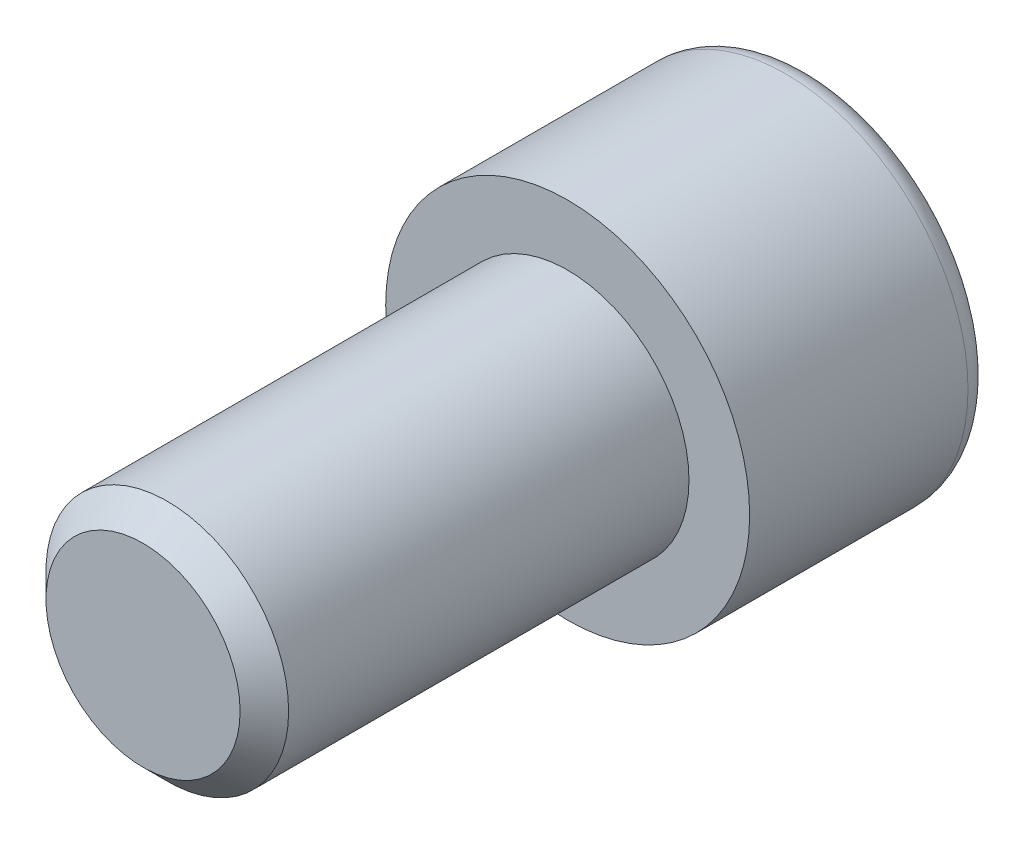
ISO-10303-21;
HEADER;
FILE_DESCRIPTION(('STEP AP214'),'2;1');
FILE_NAME('part.step','',(''),(''),'','','');
FILE_SCHEMA(('AUTOMOTIVE_DESIGN { 1 0 10303 214 1 1 1 1 }'));
ENDSEC;
DATA;
#1=APPLICATION_CONTEXT('core data for automotive mechanical design processes');
#2=APPLICATION_PROTOCOL_DEFINITION('international standard','automotive_design',2000,#1);
#3=PRODUCT_CONTEXT('',#1,'mechanical');
#4=PRODUCT('Part','Part','',(#3));
#5=PRODUCT_RELATED_PRODUCT_CATEGORY('part','',(#4));
#6=PRODUCT_DEFINITION_FORMATION('','',#4);
#7=PRODUCT_DEFINITION_CONTEXT('part definition',#1,'design');
#8=PRODUCT_DEFINITION('design','',#6,#7);
#9=PRODUCT_DEFINITION_SHAPE('','',#8);
#10=(LENGTH_UNIT() NAMED_UNIT(*) SI_UNIT(.MILLI.,.METRE.));
#11=(NAMED_UNIT(*) PLANE_ANGLE_UNIT() SI_UNIT($,.RADIAN.));
#12=(NAMED_UNIT(*) SI_UNIT($,.STERADIAN.) SOLID_ANGLE_UNIT());
#13=UNCERTAINTY_MEASURE_WITH_UNIT(LENGTH_MEASURE(1.E-05),#10,'distance_accuracy_value','');
#14=(GEOMETRIC_REPRESENTATION_CONTEXT(3) GLOBAL_UNCERTAINTY_ASSIGNED_CONTEXT((#13)) GLOBAL_UNIT_ASSIGNED_CONTEXT((#10,
#11,#12)) REPRESENTATION_CONTEXT('',''));
#15=CARTESIAN_POINT('',(0.,0.,0.));
#16=DIRECTION('',(0.,0.,1.));
#17=DIRECTION('',(1.,0.,0.));
#18=AXIS2_PLACEMENT_3D('',#15,#16,#17);
#19=CARTESIAN_POINT('',(0.,0.,-16.));
#20=DIRECTION('',(0.,0.,1.));
#21=DIRECTION('',(1.,0.,0.));
#22=AXIS2_PLACEMENT_3D('',#19,#20,#21);
#23=PLANE('',#22);
#24=CARTESIAN_POINT('',(0.,0.,-16.));
#25=DIRECTION('',(0.,0.,-1.));
#26=DIRECTION('',(-1.,0.,0.));
#27=AXIS2_PLACEMENT_3D('',#24,#25,#26);
#28=CIRCLE('',#27,10.4);
#29=CARTESIAN_POINT('',(-10.4,0.,-16.));
#30=VERTEX_POINT('',#29);
#31=EDGE_CURVE('E150',#30,#30,#28,.T.);
#32=ORIENTED_EDGE('',*,*,#31,.T.);
#33=EDGE_LOOP('',(#32));
#34=FACE_BOUND('',#33,.T.);
#35=DIRECTION('',(-0.86602540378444,0.499999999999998,0.));
#36=VECTOR('',#35,1.);
#37=CARTESIAN_POINT('',(0.,8.08290376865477,-16.));
#38=LINE('',#37,#36);
#39=CARTESIAN_POINT('',(7.,4.0414518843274,-16.));
#40=VERTEX_POINT('',#39);
#41=CARTESIAN_POINT('',(0.,8.08290376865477,-16.));
#42=VERTEX_POINT('',#41);
#43=EDGE_CURVE('E54',#40,#42,#38,.T.);
#44=ORIENTED_EDGE('',*,*,#43,.T.);
#45=DIRECTION('',(-0.866025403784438,-0.500000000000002,0.));
#46=VECTOR('',#45,1.);
#47=CARTESIAN_POINT('',(0.,8.08290376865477,-16.));
#48=LINE('',#47,#46);
#49=CARTESIAN_POINT('',(-7.,4.0414518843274,-16.));
#50=VERTEX_POINT('',#49);
#51=EDGE_CURVE('E94',#42,#50,#48,.T.);
#52=ORIENTED_EDGE('',*,*,#51,.T.);
#53=DIRECTION('',(0.,-1.,0.));
#54=VECTOR('',#53,1.);
#55=CARTESIAN_POINT('',(-7.,-4.0414518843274,-16.));
#56=LINE('',#55,#54);
#57=CARTESIAN_POINT('',(-7.,-4.0414518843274,-16.));
#58=VERTEX_POINT('',#57);
#59=EDGE_CURVE('E102',#50,#58,#56,.T.);
#60=ORIENTED_EDGE('',*,*,#59,.T.);
#61=DIRECTION('',(0.866025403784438,-0.500000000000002,0.));
#62=VECTOR('',#61,1.);
#63=CARTESIAN_POINT('',(0.,-8.08290376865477,-16.));
#64=LINE('',#63,#62);
#65=CARTESIAN_POINT('',(0.,-8.08290376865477,-16.));
#66=VERTEX_POINT('',#65);
#67=EDGE_CURVE('E120',#58,#66,#64,.T.);
#68=ORIENTED_EDGE('',*,*,#67,.T.);
#69=DIRECTION('',(0.86602540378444,0.499999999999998,0.));
#70=VECTOR('',#69,1.);
#71=CARTESIAN_POINT('',(0.,-8.08290376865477,-16.));
#72=LINE('',#71,#70);
#73=CARTESIAN_POINT('',(7.,-4.0414518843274,-16.));
#74=VERTEX_POINT('',#73);
#75=EDGE_CURVE('E123',#66,#74,#72,.T.);
#76=ORIENTED_EDGE('',*,*,#75,.T.);
#77=DIRECTION('',(0.,1.,0.));
#78=VECTOR('',#77,1.);
#79=CARTESIAN_POINT('',(7.,-4.0414518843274,-16.));
#80=LINE('',#79,#78);
#81=EDGE_CURVE('E113',#74,#40,#80,.T.);
#82=ORIENTED_EDGE('',*,*,#81,.T.);
#83=EDGE_LOOP('',(#44,#52,#60,#68,#76,#82));
#84=FACE_BOUND('',#83,.T.);
#85=ADVANCED_FACE('F39',(#34,#84),#23,.F.);
#86=CARTESIAN_POINT('',(0.,0.,-14.4));
#87=DIRECTION('',(0.,0.,-1.));
#88=DIRECTION('',(-1.,0.,0.));
#89=AXIS2_PLACEMENT_3D('',#86,#87,#88);
#90=TOROIDAL_SURFACE('',#89,10.4,1.6);
#91=ORIENTED_EDGE('',*,*,#31,.F.);
#92=EDGE_LOOP('',(#91));
#93=FACE_BOUND('',#92,.T.);
#94=CARTESIAN_POINT('',(0.,0.,-14.4));
#95=DIRECTION('',(0.,0.,-1.));
#96=DIRECTION('',(-1.,0.,0.));
#97=AXIS2_PLACEMENT_3D('',#94,#95,#96);
#98=CIRCLE('',#97,12.);
#99=CARTESIAN_POINT('',(-12.,0.,-14.4));
#100=VERTEX_POINT('',#99);
#101=EDGE_CURVE('E147',#100,#100,#98,.T.);
#102=ORIENTED_EDGE('',*,*,#101,.T.);
#103=EDGE_LOOP('',(#102));
#104=FACE_BOUND('',#103,.T.);
#105=ADVANCED_FACE('F169',(#93,#104),#90,.T.);
#106=CARTESIAN_POINT('',(0.,0.,0.));
#107=DIRECTION('',(0.,0.,-1.));
#108=DIRECTION('',(-1.,0.,0.));
#109=AXIS2_PLACEMENT_3D('',#106,#107,#108);
#110=CYLINDRICAL_SURFACE('',#109,12.);
#111=ORIENTED_EDGE('',*,*,#101,.F.);
#112=EDGE_LOOP('',(#111));
#113=FACE_BOUND('',#112,.T.);
#114=CARTESIAN_POINT('',(0.,0.,0.));
#115=DIRECTION('',(0.,0.,-1.));
#116=DIRECTION('',(-1.,0.,0.));
#117=AXIS2_PLACEMENT_3D('',#114,#115,#116);
#118=CIRCLE('',#117,12.);
#119=CARTESIAN_POINT('',(-12.,0.,0.));
#120=VERTEX_POINT('',#119);
#121=EDGE_CURVE('E108',#120,#120,#118,.T.);
#122=ORIENTED_EDGE('',*,*,#121,.T.);
#123=EDGE_LOOP('',(#122));
#124=FACE_BOUND('',#123,.T.);
#125=ADVANCED_FACE('F174',(#113,#124),#110,.T.);
#126=CARTESIAN_POINT('',(0.,0.,0.));
#127=DIRECTION('',(0.,0.,-1.));
#128=DIRECTION('',(-1.,0.,0.));
#129=AXIS2_PLACEMENT_3D('',#126,#127,#128);
#130=PLANE('',#129);
#131=CARTESIAN_POINT('',(0.,0.,0.));
#132=DIRECTION('',(0.,0.,1.));
#133=DIRECTION('',(1.,0.,0.));
#134=AXIS2_PLACEMENT_3D('',#131,#132,#133);
#135=CIRCLE('',#134,8.);
#136=CARTESIAN_POINT('',(8.,0.,0.));
#137=VERTEX_POINT('',#136);
#138=EDGE_CURVE('E114',#137,#137,#135,.T.);
#139=ORIENTED_EDGE('',*,*,#138,.F.);
#140=EDGE_LOOP('',(#139));
#141=FACE_BOUND('',#140,.T.);
#142=ORIENTED_EDGE('',*,*,#121,.F.);
#143=EDGE_LOOP('',(#142));
#144=FACE_BOUND('',#143,.T.);
#145=ADVANCED_FACE('F182',(#141,#144),#130,.F.);
#146=CARTESIAN_POINT('',(0.,8.08290376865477,-8.));
#147=DIRECTION('',(-0.499999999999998,-0.86602540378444,0.));
#148=DIRECTION('',(0.86602540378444,-0.499999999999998,0.));
#149=AXIS2_PLACEMENT_3D('',#146,#147,#148);
#150=PLANE('',#149);
#151=ORIENTED_EDGE('',*,*,#43,.F.);
#152=DIRECTION('',(0.,0.,-1.));
#153=VECTOR('',#152,1.);
#154=CARTESIAN_POINT('',(7.,4.0414518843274,-8.));
#155=LINE('',#154,#153);
#156=CARTESIAN_POINT('',(7.,4.0414518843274,-8.));
#157=VERTEX_POINT('',#156);
#158=EDGE_CURVE('E136',#157,#40,#155,.T.);
#159=ORIENTED_EDGE('',*,*,#158,.F.);
#160=DIRECTION('',(-0.86602540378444,0.499999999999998,0.));
#161=VECTOR('',#160,1.);
#162=CARTESIAN_POINT('',(0.,8.08290376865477,-8.));
#163=LINE('',#162,#161);
#164=CARTESIAN_POINT('',(0.,8.08290376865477,-8.));
#165=VERTEX_POINT('',#164);
#166=EDGE_CURVE('E107',#157,#165,#163,.T.);
#167=ORIENTED_EDGE('',*,*,#166,.T.);
#168=DIRECTION('',(0.,0.,-1.));
#169=VECTOR('',#168,1.);
#170=CARTESIAN_POINT('',(0.,8.08290376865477,-8.));
#171=LINE('',#170,#169);
#172=EDGE_CURVE('E96',#165,#42,#171,.T.);
#173=ORIENTED_EDGE('',*,*,#172,.T.);
#174=EDGE_LOOP('',(#151,#159,#167,#173));
#175=FACE_BOUND('',#174,.T.);
#176=ADVANCED_FACE('F105',(#175),#150,.T.);
#177=CARTESIAN_POINT('',(0.,8.08290376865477,-8.));
#178=DIRECTION('',(0.500000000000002,-0.866025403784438,0.));
#179=DIRECTION('',(0.866025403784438,0.500000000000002,0.));
#180=AXIS2_PLACEMENT_3D('',#177,#178,#179);
#181=PLANE('',#180);
#182=ORIENTED_EDGE('',*,*,#51,.F.);
#183=ORIENTED_EDGE('',*,*,#172,.F.);
#184=DIRECTION('',(-0.866025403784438,-0.500000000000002,0.));
#185=VECTOR('',#184,1.);
#186=CARTESIAN_POINT('',(0.,8.08290376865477,-8.));
#187=LINE('',#186,#185);
#188=CARTESIAN_POINT('',(-7.,4.0414518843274,-8.));
#189=VERTEX_POINT('',#188);
#190=EDGE_CURVE('E127',#165,#189,#187,.T.);
#191=ORIENTED_EDGE('',*,*,#190,.T.);
#192=DIRECTION('',(0.,0.,-1.));
#193=VECTOR('',#192,1.);
#194=CARTESIAN_POINT('',(-7.,4.0414518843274,-8.));
#195=LINE('',#194,#193);
#196=EDGE_CURVE('E98',#189,#50,#195,.T.);
#197=ORIENTED_EDGE('',*,*,#196,.T.);
#198=EDGE_LOOP('',(#182,#183,#191,#197));
#199=FACE_BOUND('',#198,.T.);
#200=ADVANCED_FACE('F95',(#199),#181,.T.);
#201=CARTESIAN_POINT('',(-7.,-4.0414518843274,-8.));
#202=DIRECTION('',(1.,0.,0.));
#203=DIRECTION('',(0.,0.,-1.));
#204=AXIS2_PLACEMENT_3D('',#201,#202,#203);
#205=PLANE('',#204);
#206=ORIENTED_EDGE('',*,*,#59,.F.);
#207=ORIENTED_EDGE('',*,*,#196,.F.);
#208=DIRECTION('',(0.,-1.,0.));
#209=VECTOR('',#208,1.);
#210=CARTESIAN_POINT('',(-7.,-4.0414518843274,-8.));
#211=LINE('',#210,#209);
#212=CARTESIAN_POINT('',(-7.,-4.0414518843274,-8.));
#213=VERTEX_POINT('',#212);
#214=EDGE_CURVE('E129',#189,#213,#211,.T.);
#215=ORIENTED_EDGE('',*,*,#214,.T.);
#216=DIRECTION('',(0.,0.,-1.));
#217=VECTOR('',#216,1.);
#218=CARTESIAN_POINT('',(-7.,-4.0414518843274,-8.));
#219=LINE('',#218,#217);
#220=EDGE_CURVE('E142',#213,#58,#219,.T.);
#221=ORIENTED_EDGE('',*,*,#220,.T.);
#222=EDGE_LOOP('',(#206,#207,#215,#221));
#223=FACE_BOUND('',#222,.T.);
#224=ADVANCED_FACE('F197',(#223),#205,.T.);
#225=CARTESIAN_POINT('',(0.,-8.08290376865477,-8.));
#226=DIRECTION('',(0.500000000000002,0.866025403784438,0.));
#227=DIRECTION('',(-0.866025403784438,0.500000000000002,0.));
#228=AXIS2_PLACEMENT_3D('',#225,#226,#227);
#229=PLANE('',#228);
#230=ORIENTED_EDGE('',*,*,#67,.F.);
#231=ORIENTED_EDGE('',*,*,#220,.F.);
#232=DIRECTION('',(0.866025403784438,-0.500000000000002,0.));
#233=VECTOR('',#232,1.);
#234=CARTESIAN_POINT('',(0.,-8.08290376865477,-8.));
#235=LINE('',#234,#233);
#236=CARTESIAN_POINT('',(0.,-8.08290376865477,-8.));
#237=VERTEX_POINT('',#236);
#238=EDGE_CURVE('E131',#213,#237,#235,.T.);
#239=ORIENTED_EDGE('',*,*,#238,.T.);
#240=DIRECTION('',(0.,0.,-1.));
#241=VECTOR('',#240,1.);
#242=CARTESIAN_POINT('',(0.,-8.08290376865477,-8.));
#243=LINE('',#242,#241);
#244=EDGE_CURVE('E140',#237,#66,#243,.T.);
#245=ORIENTED_EDGE('',*,*,#244,.T.);
#246=EDGE_LOOP('',(#230,#231,#239,#245));
#247=FACE_BOUND('',#246,.T.);
#248=ADVANCED_FACE('F200',(#247),#229,.T.);
#249=CARTESIAN_POINT('',(0.,-8.08290376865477,-8.));
#250=DIRECTION('',(-0.499999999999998,0.86602540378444,0.));
#251=DIRECTION('',(-0.86602540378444,-0.499999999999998,0.));
#252=AXIS2_PLACEMENT_3D('',#249,#250,#251);
#253=PLANE('',#252);
#254=ORIENTED_EDGE('',*,*,#75,.F.);
#255=ORIENTED_EDGE('',*,*,#244,.F.);
#256=DIRECTION('',(0.86602540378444,0.499999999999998,0.));
#257=VECTOR('',#256,1.);
#258=CARTESIAN_POINT('',(0.,-8.08290376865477,-8.));
#259=LINE('',#258,#257);
#260=CARTESIAN_POINT('',(7.,-4.0414518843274,-8.));
#261=VERTEX_POINT('',#260);
#262=EDGE_CURVE('E133',#237,#261,#259,.T.);
#263=ORIENTED_EDGE('',*,*,#262,.T.);
#264=DIRECTION('',(0.,0.,-1.));
#265=VECTOR('',#264,1.);
#266=CARTESIAN_POINT('',(7.,-4.0414518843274,-8.));
#267=LINE('',#266,#265);
#268=EDGE_CURVE('E138',#261,#74,#267,.T.);
#269=ORIENTED_EDGE('',*,*,#268,.T.);
#270=EDGE_LOOP('',(#254,#255,#263,#269));
#271=FACE_BOUND('',#270,.T.);
#272=ADVANCED_FACE('F204',(#271),#253,.T.);
#273=CARTESIAN_POINT('',(7.,-4.0414518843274,-8.));
#274=DIRECTION('',(-1.,0.,0.));
#275=DIRECTION('',(0.,0.,1.));
#276=AXIS2_PLACEMENT_3D('',#273,#274,#275);
#277=PLANE('',#276);
#278=ORIENTED_EDGE('',*,*,#81,.F.);
#279=ORIENTED_EDGE('',*,*,#268,.F.);
#280=DIRECTION('',(0.,1.,0.));
#281=VECTOR('',#280,1.);
#282=CARTESIAN_POINT('',(7.,-4.0414518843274,-8.));
#283=LINE('',#282,#281);
#284=EDGE_CURVE('E61',#261,#157,#283,.T.);
#285=ORIENTED_EDGE('',*,*,#284,.T.);
#286=ORIENTED_EDGE('',*,*,#158,.T.);
#287=EDGE_LOOP('',(#278,#279,#285,#286));
#288=FACE_BOUND('',#287,.T.);
#289=ADVANCED_FACE('F208',(#288),#277,.T.);
#290=CARTESIAN_POINT('',(7.,4.0414518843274,-8.));
#291=DIRECTION('',(0.,0.,1.));
#292=DIRECTION('',(1.,0.,0.));
#293=AXIS2_PLACEMENT_3D('',#290,#291,#292);
#294=PLANE('',#293);
#295=ORIENTED_EDGE('',*,*,#166,.F.);
#296=ORIENTED_EDGE('',*,*,#284,.F.);
#297=ORIENTED_EDGE('',*,*,#262,.F.);
#298=ORIENTED_EDGE('',*,*,#238,.F.);
#299=ORIENTED_EDGE('',*,*,#214,.F.);
#300=ORIENTED_EDGE('',*,*,#190,.F.);
#301=EDGE_LOOP('',(#295,#296,#297,#298,#299,#300));
#302=FACE_BOUND('',#301,.T.);
#303=ADVANCED_FACE('F212',(#302),#294,.F.);
#304=CARTESIAN_POINT('',(0.,0.,28.));
#305=DIRECTION('',(0.,0.,1.));
#306=DIRECTION('',(1.,0.,0.));
#307=AXIS2_PLACEMENT_3D('',#304,#305,#306);
#308=PLANE('',#307);
#309=CARTESIAN_POINT('',(0.,0.,28.));
#310=DIRECTION('',(0.,0.,1.));
#311=DIRECTION('',(1.,0.,0.));
#312=AXIS2_PLACEMENT_3D('',#309,#310,#311);
#313=CIRCLE('',#312,6.4);
#314=CARTESIAN_POINT('',(6.4,0.,28.));
#315=VERTEX_POINT('',#314);
#316=EDGE_CURVE('E46',#315,#315,#313,.T.);
#317=ORIENTED_EDGE('',*,*,#316,.T.);
#318=EDGE_LOOP('',(#317));
#319=FACE_BOUND('',#318,.T.);
#320=ADVANCED_FACE('F155',(#319),#308,.T.);
#321=CARTESIAN_POINT('',(0.,0.,0.));
#322=DIRECTION('',(0.,0.,1.));
#323=DIRECTION('',(1.,0.,0.));
#324=AXIS2_PLACEMENT_3D('',#321,#322,#323);
#325=CYLINDRICAL_SURFACE('',#324,8.);
#326=CARTESIAN_POINT('',(0.,0.,26.4));
#327=DIRECTION('',(0.,0.,1.));
#328=DIRECTION('',(1.,0.,0.));
#329=AXIS2_PLACEMENT_3D('',#326,#327,#328);
#330=CIRCLE('',#329,8.);
#331=CARTESIAN_POINT('',(8.,0.,26.4));
#332=VERTEX_POINT('',#331);
#333=EDGE_CURVE('E11',#332,#332,#330,.F.);
#334=ORIENTED_EDGE('',*,*,#333,.T.);
#335=EDGE_LOOP('',(#334));
#336=FACE_BOUND('',#335,.T.);
#337=ORIENTED_EDGE('',*,*,#138,.T.);
#338=EDGE_LOOP('',(#337));
#339=FACE_BOUND('',#338,.T.);
#340=ADVANCED_FACE('F159',(#336,#339),#325,.T.);
#341=CARTESIAN_POINT('',(0.,0.,28.));
#342=DIRECTION('',(0.,0.,-1.));
#343=DIRECTION('',(-1.,0.,0.));
#344=AXIS2_PLACEMENT_3D('',#341,#342,#343);
#345=CONICAL_SURFACE('',#344,6.4,0.785398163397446);
#346=ORIENTED_EDGE('',*,*,#333,.F.);
#347=EDGE_LOOP('',(#346));
#348=FACE_BOUND('',#347,.T.);
#349=ORIENTED_EDGE('',*,*,#316,.F.);
#350=EDGE_LOOP('',(#349));
#351=FACE_BOUND('',#350,.T.);
#352=ADVANCED_FACE('F157',(#348,#351),#345,.T.);
#353=CLOSED_SHELL('',(#85,#105,#125,#145,#176,#200,#224,#248,#272,#289,#303,#320,#340,#352));
#354=MANIFOLD_SOLID_BREP('B2',#353);
#355=ADVANCED_BREP_SHAPE_REPRESENTATION('',(#18,#354),#14);
#356=SHAPE_DEFINITION_REPRESENTATION(#9,#355);
ENDSEC;
END-ISO-10303-21;
